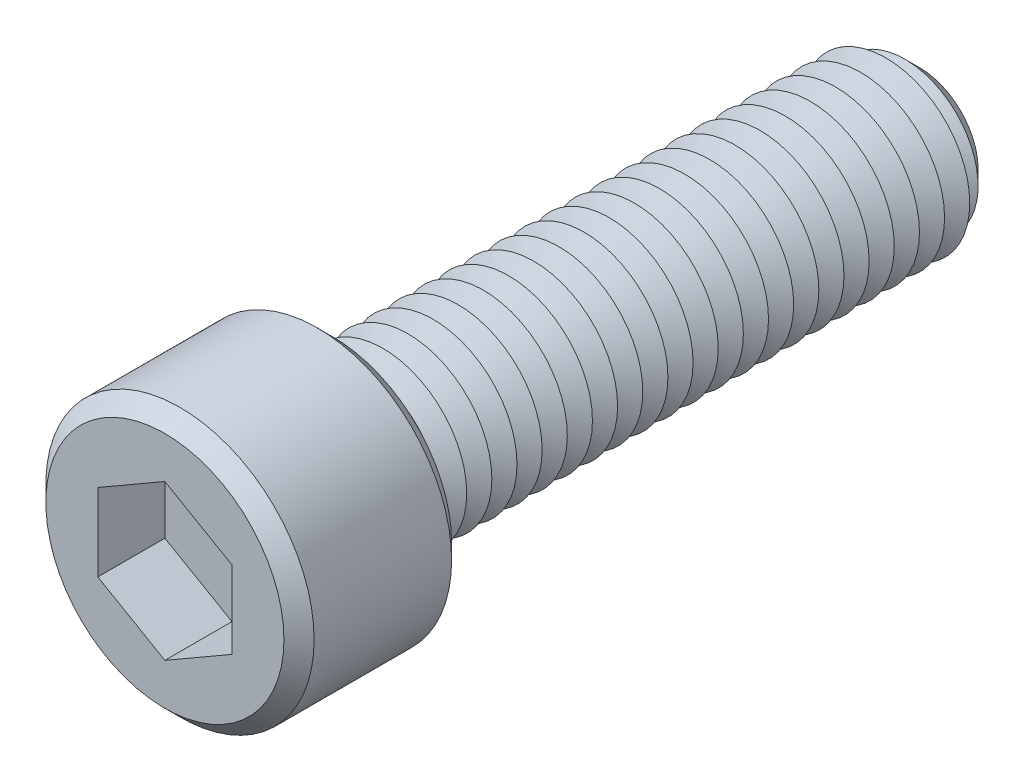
ISO-10303-21;
HEADER;
FILE_DESCRIPTION(('STEP AP214'),'2;1');
FILE_NAME('part.step','',(''),(''),'','','');
FILE_SCHEMA(('AUTOMOTIVE_DESIGN { 1 0 10303 214 1 1 1 1 }'));
ENDSEC;
DATA;
#1=APPLICATION_CONTEXT('core data for automotive mechanical design processes');
#2=APPLICATION_PROTOCOL_DEFINITION('international standard','automotive_design',2000,#1);
#3=PRODUCT_CONTEXT('',#1,'mechanical');
#4=PRODUCT('Part','Part','',(#3));
#5=PRODUCT_RELATED_PRODUCT_CATEGORY('part','',(#4));
#6=PRODUCT_DEFINITION_FORMATION('','',#4);
#7=PRODUCT_DEFINITION_CONTEXT('part definition',#1,'design');
#8=PRODUCT_DEFINITION('design','',#6,#7);
#9=PRODUCT_DEFINITION_SHAPE('','',#8);
#10=(LENGTH_UNIT() NAMED_UNIT(*) SI_UNIT(.MILLI.,.METRE.));
#11=(NAMED_UNIT(*) PLANE_ANGLE_UNIT() SI_UNIT($,.RADIAN.));
#12=(NAMED_UNIT(*) SI_UNIT($,.STERADIAN.) SOLID_ANGLE_UNIT());
#13=UNCERTAINTY_MEASURE_WITH_UNIT(LENGTH_MEASURE(1.E-05),#10,'distance_accuracy_value','');
#14=(GEOMETRIC_REPRESENTATION_CONTEXT(3) GLOBAL_UNCERTAINTY_ASSIGNED_CONTEXT((#13)) GLOBAL_UNIT_ASSIGNED_CONTEXT((#10,
#11,#12)) REPRESENTATION_CONTEXT('',''));
#15=CARTESIAN_POINT('',(0.,0.,0.));
#16=DIRECTION('',(0.,0.,1.));
#17=DIRECTION('',(1.,0.,0.));
#18=AXIS2_PLACEMENT_3D('',#15,#16,#17);
#19=CARTESIAN_POINT('',(0.,0.,10.));
#20=DIRECTION('',(0.,0.,-1.));
#21=DIRECTION('',(-1.,0.,0.));
#22=AXIS2_PLACEMENT_3D('',#19,#20,#21);
#23=CYLINDRICAL_SURFACE('',#22,8.);
#24=CARTESIAN_POINT('',(0.,0.,0.899999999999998));
#25=DIRECTION('',(0.,0.,1.));
#26=DIRECTION('',(1.,0.,0.));
#27=AXIS2_PLACEMENT_3D('',#24,#25,#26);
#28=CIRCLE('',#27,8.);
#29=CARTESIAN_POINT('',(8.,0.,0.899999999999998));
#30=VERTEX_POINT('',#29);
#31=EDGE_CURVE('E360',#30,#30,#28,.T.);
#32=ORIENTED_EDGE('',*,*,#31,.T.);
#33=EDGE_LOOP('',(#32));
#34=FACE_BOUND('',#33,.T.);
#35=CARTESIAN_POINT('',(0.,0.,9.1));
#36=DIRECTION('',(0.,0.,1.));
#37=DIRECTION('',(1.,0.,0.));
#38=AXIS2_PLACEMENT_3D('',#35,#36,#37);
#39=CIRCLE('',#38,8.);
#40=CARTESIAN_POINT('',(8.,0.,9.1));
#41=VERTEX_POINT('',#40);
#42=EDGE_CURVE('E353',#41,#41,#39,.F.);
#43=ORIENTED_EDGE('',*,*,#42,.T.);
#44=EDGE_LOOP('',(#43));
#45=FACE_BOUND('',#44,.T.);
#46=ADVANCED_FACE('F39',(#34,#45),#23,.T.);
#47=CARTESIAN_POINT('',(0.,0.,10.));
#48=DIRECTION('',(0.,0.,1.));
#49=DIRECTION('',(1.,0.,0.));
#50=AXIS2_PLACEMENT_3D('',#47,#48,#49);
#51=PLANE('',#50);
#52=CARTESIAN_POINT('',(0.,0.,10.));
#53=DIRECTION('',(0.,0.,1.));
#54=DIRECTION('',(1.,0.,0.));
#55=AXIS2_PLACEMENT_3D('',#52,#53,#54);
#56=CIRCLE('',#55,7.1);
#57=CARTESIAN_POINT('',(7.1,0.,10.));
#58=VERTEX_POINT('',#57);
#59=EDGE_CURVE('E11',#58,#58,#56,.T.);
#60=ORIENTED_EDGE('',*,*,#59,.T.);
#61=EDGE_LOOP('',(#60));
#62=FACE_BOUND('',#61,.T.);
#63=DIRECTION('',(-0.866025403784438,0.5,0.));
#64=VECTOR('',#63,1.);
#65=CARTESIAN_POINT('',(4.,2.3094010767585,10.));
#66=LINE('',#65,#64);
#67=CARTESIAN_POINT('',(4.,2.3094010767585,10.));
#68=VERTEX_POINT('',#67);
#69=CARTESIAN_POINT('',(0.,4.61880215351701,10.));
#70=VERTEX_POINT('',#69);
#71=EDGE_CURVE('E55',#68,#70,#66,.T.);
#72=ORIENTED_EDGE('',*,*,#71,.F.);
#73=DIRECTION('',(0.,1.,0.));
#74=VECTOR('',#73,1.);
#75=CARTESIAN_POINT('',(4.,-2.30940107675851,10.));
#76=LINE('',#75,#74);
#77=CARTESIAN_POINT('',(4.,-2.30940107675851,10.));
#78=VERTEX_POINT('',#77);
#79=EDGE_CURVE('E150',#78,#68,#76,.T.);
#80=ORIENTED_EDGE('',*,*,#79,.F.);
#81=DIRECTION('',(0.866025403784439,0.5,0.));
#82=VECTOR('',#81,1.);
#83=CARTESIAN_POINT('',(0.,-4.61880215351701,10.));
#84=LINE('',#83,#82);
#85=CARTESIAN_POINT('',(0.,-4.61880215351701,10.));
#86=VERTEX_POINT('',#85);
#87=EDGE_CURVE('E147',#86,#78,#84,.T.);
#88=ORIENTED_EDGE('',*,*,#87,.F.);
#89=DIRECTION('',(0.866025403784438,-0.5,0.));
#90=VECTOR('',#89,1.);
#91=CARTESIAN_POINT('',(-4.,-2.3094010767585,10.));
#92=LINE('',#91,#90);
#93=CARTESIAN_POINT('',(-4.,-2.3094010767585,10.));
#94=VERTEX_POINT('',#93);
#95=EDGE_CURVE('E103',#94,#86,#92,.T.);
#96=ORIENTED_EDGE('',*,*,#95,.F.);
#97=DIRECTION('',(0.,-1.,0.));
#98=VECTOR('',#97,1.);
#99=CARTESIAN_POINT('',(-4.,2.3094010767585,10.));
#100=LINE('',#99,#98);
#101=CARTESIAN_POINT('',(-4.,2.3094010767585,10.));
#102=VERTEX_POINT('',#101);
#103=EDGE_CURVE('E141',#102,#94,#100,.T.);
#104=ORIENTED_EDGE('',*,*,#103,.F.);
#105=DIRECTION('',(-0.866025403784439,-0.5,0.));
#106=VECTOR('',#105,1.);
#107=CARTESIAN_POINT('',(0.,4.61880215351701,10.));
#108=LINE('',#107,#106);
#109=EDGE_CURVE('E136',#70,#102,#108,.T.);
#110=ORIENTED_EDGE('',*,*,#109,.F.);
#111=EDGE_LOOP('',(#72,#80,#88,#96,#104,#110));
#112=FACE_BOUND('',#111,.T.);
#113=ADVANCED_FACE('F378',(#62,#112),#51,.T.);
#114=CARTESIAN_POINT('',(0.,0.,0.));
#115=DIRECTION('',(0.,0.,1.));
#116=DIRECTION('',(1.,0.,0.));
#117=AXIS2_PLACEMENT_3D('',#114,#115,#116);
#118=PLANE('',#117);
#119=CARTESIAN_POINT('',(0.,0.,0.));
#120=DIRECTION('',(0.,0.,1.));
#121=DIRECTION('',(1.,0.,0.));
#122=AXIS2_PLACEMENT_3D('',#119,#120,#121);
#123=CIRCLE('',#122,7.1);
#124=CARTESIAN_POINT('',(7.1,0.,0.));
#125=VERTEX_POINT('',#124);
#126=EDGE_CURVE('E48',#125,#125,#123,.F.);
#127=ORIENTED_EDGE('',*,*,#126,.T.);
#128=EDGE_LOOP('',(#127));
#129=FACE_BOUND('',#128,.T.);
#130=CARTESIAN_POINT('',(0.,0.,0.));
#131=DIRECTION('',(0.,0.,1.));
#132=DIRECTION('',(1.,0.,0.));
#133=AXIS2_PLACEMENT_3D('',#130,#131,#132);
#134=CIRCLE('',#133,5.);
#135=CARTESIAN_POINT('',(5.,0.,0.));
#136=VERTEX_POINT('',#135);
#137=EDGE_CURVE('E345',#136,#136,#134,.T.);
#138=ORIENTED_EDGE('',*,*,#137,.T.);
#139=EDGE_LOOP('',(#138));
#140=FACE_BOUND('',#139,.T.);
#141=ADVANCED_FACE('F367',(#129,#140),#118,.F.);
#142=CARTESIAN_POINT('',(0.,0.,0.));
#143=DIRECTION('',(0.,0.,1.));
#144=DIRECTION('',(1.,0.,0.));
#145=AXIS2_PLACEMENT_3D('',#142,#143,#144);
#146=CONICAL_SURFACE('',#145,5.,1.0471975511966);
#147=CARTESIAN_POINT('',(0.,0.,-0.750000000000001));
#148=DIRECTION('',(0.,0.,1.));
#149=DIRECTION('',(1.,0.,0.));
#150=AXIS2_PLACEMENT_3D('',#147,#148,#149);
#151=CIRCLE('',#150,3.70096189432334);
#152=CARTESIAN_POINT('',(3.70096189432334,0.,-0.750000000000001));
#153=VERTEX_POINT('',#152);
#154=EDGE_CURVE('E341',#153,#153,#151,.T.);
#155=ORIENTED_EDGE('',*,*,#154,.T.);
#156=EDGE_LOOP('',(#155));
#157=FACE_BOUND('',#156,.T.);
#158=ORIENTED_EDGE('',*,*,#137,.F.);
#159=EDGE_LOOP('',(#158));
#160=FACE_BOUND('',#159,.T.);
#161=ADVANCED_FACE('F612',(#157,#160),#146,.T.);
#162=CARTESIAN_POINT('',(0.,0.,-0.750000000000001));
#163=DIRECTION('',(0.,0.,-1.));
#164=DIRECTION('',(-1.,0.,0.));
#165=AXIS2_PLACEMENT_3D('',#162,#163,#164);
#166=CONICAL_SURFACE('',#165,3.70096189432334,1.0471975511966);
#167=CARTESIAN_POINT('',(0.,0.,-1.5));
#168=DIRECTION('',(0.,0.,1.));
#169=DIRECTION('',(1.,0.,0.));
#170=AXIS2_PLACEMENT_3D('',#167,#168,#169);
#171=CIRCLE('',#170,5.);
#172=CARTESIAN_POINT('',(5.,0.,-1.5));
#173=VERTEX_POINT('',#172);
#174=EDGE_CURVE('E337',#173,#173,#171,.T.);
#175=ORIENTED_EDGE('',*,*,#174,.T.);
#176=EDGE_LOOP('',(#175));
#177=FACE_BOUND('',#176,.T.);
#178=ORIENTED_EDGE('',*,*,#154,.F.);
#179=EDGE_LOOP('',(#178));
#180=FACE_BOUND('',#179,.T.);
#181=ADVANCED_FACE('F608',(#177,#180),#166,.T.);
#182=CARTESIAN_POINT('',(0.,0.,-1.5));
#183=DIRECTION('',(0.,0.,1.));
#184=DIRECTION('',(1.,0.,0.));
#185=AXIS2_PLACEMENT_3D('',#182,#183,#184);
#186=CONICAL_SURFACE('',#185,5.,1.0471975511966);
#187=CARTESIAN_POINT('',(0.,0.,-2.25));
#188=DIRECTION('',(0.,0.,1.));
#189=DIRECTION('',(1.,0.,0.));
#190=AXIS2_PLACEMENT_3D('',#187,#188,#189);
#191=CIRCLE('',#190,3.70096189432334);
#192=CARTESIAN_POINT('',(3.70096189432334,0.,-2.25));
#193=VERTEX_POINT('',#192);
#194=EDGE_CURVE('E333',#193,#193,#191,.T.);
#195=ORIENTED_EDGE('',*,*,#194,.T.);
#196=EDGE_LOOP('',(#195));
#197=FACE_BOUND('',#196,.T.);
#198=ORIENTED_EDGE('',*,*,#174,.F.);
#199=EDGE_LOOP('',(#198));
#200=FACE_BOUND('',#199,.T.);
#201=ADVANCED_FACE('F604',(#197,#200),#186,.T.);
#202=CARTESIAN_POINT('',(0.,0.,-2.25));
#203=DIRECTION('',(0.,0.,-1.));
#204=DIRECTION('',(-1.,0.,0.));
#205=AXIS2_PLACEMENT_3D('',#202,#203,#204);
#206=CONICAL_SURFACE('',#205,3.70096189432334,1.0471975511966);
#207=CARTESIAN_POINT('',(0.,0.,-3.));
#208=DIRECTION('',(0.,0.,1.));
#209=DIRECTION('',(1.,0.,0.));
#210=AXIS2_PLACEMENT_3D('',#207,#208,#209);
#211=CIRCLE('',#210,5.);
#212=CARTESIAN_POINT('',(5.,0.,-3.));
#213=VERTEX_POINT('',#212);
#214=EDGE_CURVE('E329',#213,#213,#211,.T.);
#215=ORIENTED_EDGE('',*,*,#214,.T.);
#216=EDGE_LOOP('',(#215));
#217=FACE_BOUND('',#216,.T.);
#218=ORIENTED_EDGE('',*,*,#194,.F.);
#219=EDGE_LOOP('',(#218));
#220=FACE_BOUND('',#219,.T.);
#221=ADVANCED_FACE('F600',(#217,#220),#206,.T.);
#222=CARTESIAN_POINT('',(0.,0.,-3.));
#223=DIRECTION('',(0.,0.,1.));
#224=DIRECTION('',(1.,0.,0.));
#225=AXIS2_PLACEMENT_3D('',#222,#223,#224);
#226=CONICAL_SURFACE('',#225,5.,1.0471975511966);
#227=CARTESIAN_POINT('',(0.,0.,-3.75));
#228=DIRECTION('',(0.,0.,1.));
#229=DIRECTION('',(1.,0.,0.));
#230=AXIS2_PLACEMENT_3D('',#227,#228,#229);
#231=CIRCLE('',#230,3.70096189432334);
#232=CARTESIAN_POINT('',(3.70096189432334,0.,-3.75));
#233=VERTEX_POINT('',#232);
#234=EDGE_CURVE('E325',#233,#233,#231,.T.);
#235=ORIENTED_EDGE('',*,*,#234,.T.);
#236=EDGE_LOOP('',(#235));
#237=FACE_BOUND('',#236,.T.);
#238=ORIENTED_EDGE('',*,*,#214,.F.);
#239=EDGE_LOOP('',(#238));
#240=FACE_BOUND('',#239,.T.);
#241=ADVANCED_FACE('F596',(#237,#240),#226,.T.);
#242=CARTESIAN_POINT('',(0.,0.,-3.75));
#243=DIRECTION('',(0.,0.,-1.));
#244=DIRECTION('',(-1.,0.,0.));
#245=AXIS2_PLACEMENT_3D('',#242,#243,#244);
#246=CONICAL_SURFACE('',#245,3.70096189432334,1.0471975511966);
#247=CARTESIAN_POINT('',(0.,0.,-4.5));
#248=DIRECTION('',(0.,0.,1.));
#249=DIRECTION('',(1.,0.,0.));
#250=AXIS2_PLACEMENT_3D('',#247,#248,#249);
#251=CIRCLE('',#250,5.);
#252=CARTESIAN_POINT('',(5.,0.,-4.5));
#253=VERTEX_POINT('',#252);
#254=EDGE_CURVE('E321',#253,#253,#251,.T.);
#255=ORIENTED_EDGE('',*,*,#254,.T.);
#256=EDGE_LOOP('',(#255));
#257=FACE_BOUND('',#256,.T.);
#258=ORIENTED_EDGE('',*,*,#234,.F.);
#259=EDGE_LOOP('',(#258));
#260=FACE_BOUND('',#259,.T.);
#261=ADVANCED_FACE('F592',(#257,#260),#246,.T.);
#262=CARTESIAN_POINT('',(0.,0.,-4.5));
#263=DIRECTION('',(0.,0.,1.));
#264=DIRECTION('',(1.,0.,0.));
#265=AXIS2_PLACEMENT_3D('',#262,#263,#264);
#266=CONICAL_SURFACE('',#265,5.,1.0471975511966);
#267=CARTESIAN_POINT('',(0.,0.,-5.25));
#268=DIRECTION('',(0.,0.,1.));
#269=DIRECTION('',(1.,0.,0.));
#270=AXIS2_PLACEMENT_3D('',#267,#268,#269);
#271=CIRCLE('',#270,3.70096189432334);
#272=CARTESIAN_POINT('',(3.70096189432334,0.,-5.25));
#273=VERTEX_POINT('',#272);
#274=EDGE_CURVE('E317',#273,#273,#271,.T.);
#275=ORIENTED_EDGE('',*,*,#274,.T.);
#276=EDGE_LOOP('',(#275));
#277=FACE_BOUND('',#276,.T.);
#278=ORIENTED_EDGE('',*,*,#254,.F.);
#279=EDGE_LOOP('',(#278));
#280=FACE_BOUND('',#279,.T.);
#281=ADVANCED_FACE('F588',(#277,#280),#266,.T.);
#282=CARTESIAN_POINT('',(0.,0.,-5.25));
#283=DIRECTION('',(0.,0.,-1.));
#284=DIRECTION('',(-1.,0.,0.));
#285=AXIS2_PLACEMENT_3D('',#282,#283,#284);
#286=CONICAL_SURFACE('',#285,3.70096189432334,1.0471975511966);
#287=CARTESIAN_POINT('',(0.,0.,-6.));
#288=DIRECTION('',(0.,0.,1.));
#289=DIRECTION('',(1.,0.,0.));
#290=AXIS2_PLACEMENT_3D('',#287,#288,#289);
#291=CIRCLE('',#290,5.);
#292=CARTESIAN_POINT('',(5.,0.,-6.));
#293=VERTEX_POINT('',#292);
#294=EDGE_CURVE('E313',#293,#293,#291,.T.);
#295=ORIENTED_EDGE('',*,*,#294,.T.);
#296=EDGE_LOOP('',(#295));
#297=FACE_BOUND('',#296,.T.);
#298=ORIENTED_EDGE('',*,*,#274,.F.);
#299=EDGE_LOOP('',(#298));
#300=FACE_BOUND('',#299,.T.);
#301=ADVANCED_FACE('F584',(#297,#300),#286,.T.);
#302=CARTESIAN_POINT('',(0.,0.,-6.));
#303=DIRECTION('',(0.,0.,1.));
#304=DIRECTION('',(1.,0.,0.));
#305=AXIS2_PLACEMENT_3D('',#302,#303,#304);
#306=CONICAL_SURFACE('',#305,5.,1.0471975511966);
#307=CARTESIAN_POINT('',(0.,0.,-6.75));
#308=DIRECTION('',(0.,0.,1.));
#309=DIRECTION('',(1.,0.,0.));
#310=AXIS2_PLACEMENT_3D('',#307,#308,#309);
#311=CIRCLE('',#310,3.70096189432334);
#312=CARTESIAN_POINT('',(3.70096189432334,0.,-6.75));
#313=VERTEX_POINT('',#312);
#314=EDGE_CURVE('E309',#313,#313,#311,.T.);
#315=ORIENTED_EDGE('',*,*,#314,.T.);
#316=EDGE_LOOP('',(#315));
#317=FACE_BOUND('',#316,.T.);
#318=ORIENTED_EDGE('',*,*,#294,.F.);
#319=EDGE_LOOP('',(#318));
#320=FACE_BOUND('',#319,.T.);
#321=ADVANCED_FACE('F580',(#317,#320),#306,.T.);
#322=CARTESIAN_POINT('',(0.,0.,-6.75));
#323=DIRECTION('',(0.,0.,-1.));
#324=DIRECTION('',(-1.,0.,0.));
#325=AXIS2_PLACEMENT_3D('',#322,#323,#324);
#326=CONICAL_SURFACE('',#325,3.70096189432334,1.0471975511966);
#327=CARTESIAN_POINT('',(0.,0.,-7.5));
#328=DIRECTION('',(0.,0.,1.));
#329=DIRECTION('',(1.,0.,0.));
#330=AXIS2_PLACEMENT_3D('',#327,#328,#329);
#331=CIRCLE('',#330,5.);
#332=CARTESIAN_POINT('',(5.,0.,-7.5));
#333=VERTEX_POINT('',#332);
#334=EDGE_CURVE('E305',#333,#333,#331,.T.);
#335=ORIENTED_EDGE('',*,*,#334,.T.);
#336=EDGE_LOOP('',(#335));
#337=FACE_BOUND('',#336,.T.);
#338=ORIENTED_EDGE('',*,*,#314,.F.);
#339=EDGE_LOOP('',(#338));
#340=FACE_BOUND('',#339,.T.);
#341=ADVANCED_FACE('F576',(#337,#340),#326,.T.);
#342=CARTESIAN_POINT('',(0.,0.,-7.5));
#343=DIRECTION('',(0.,0.,1.));
#344=DIRECTION('',(1.,0.,0.));
#345=AXIS2_PLACEMENT_3D('',#342,#343,#344);
#346=CONICAL_SURFACE('',#345,5.,1.0471975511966);
#347=CARTESIAN_POINT('',(0.,0.,-8.25));
#348=DIRECTION('',(0.,0.,1.));
#349=DIRECTION('',(1.,0.,0.));
#350=AXIS2_PLACEMENT_3D('',#347,#348,#349);
#351=CIRCLE('',#350,3.70096189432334);
#352=CARTESIAN_POINT('',(3.70096189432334,0.,-8.25));
#353=VERTEX_POINT('',#352);
#354=EDGE_CURVE('E301',#353,#353,#351,.T.);
#355=ORIENTED_EDGE('',*,*,#354,.T.);
#356=EDGE_LOOP('',(#355));
#357=FACE_BOUND('',#356,.T.);
#358=ORIENTED_EDGE('',*,*,#334,.F.);
#359=EDGE_LOOP('',(#358));
#360=FACE_BOUND('',#359,.T.);
#361=ADVANCED_FACE('F572',(#357,#360),#346,.T.);
#362=CARTESIAN_POINT('',(0.,0.,-8.25));
#363=DIRECTION('',(0.,0.,-1.));
#364=DIRECTION('',(-1.,0.,0.));
#365=AXIS2_PLACEMENT_3D('',#362,#363,#364);
#366=CONICAL_SURFACE('',#365,3.70096189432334,1.0471975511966);
#367=CARTESIAN_POINT('',(0.,0.,-9.));
#368=DIRECTION('',(0.,0.,1.));
#369=DIRECTION('',(1.,0.,0.));
#370=AXIS2_PLACEMENT_3D('',#367,#368,#369);
#371=CIRCLE('',#370,5.);
#372=CARTESIAN_POINT('',(5.,0.,-9.));
#373=VERTEX_POINT('',#372);
#374=EDGE_CURVE('E297',#373,#373,#371,.T.);
#375=ORIENTED_EDGE('',*,*,#374,.T.);
#376=EDGE_LOOP('',(#375));
#377=FACE_BOUND('',#376,.T.);
#378=ORIENTED_EDGE('',*,*,#354,.F.);
#379=EDGE_LOOP('',(#378));
#380=FACE_BOUND('',#379,.T.);
#381=ADVANCED_FACE('F568',(#377,#380),#366,.T.);
#382=CARTESIAN_POINT('',(0.,0.,-9.));
#383=DIRECTION('',(0.,0.,1.));
#384=DIRECTION('',(1.,0.,0.));
#385=AXIS2_PLACEMENT_3D('',#382,#383,#384);
#386=CONICAL_SURFACE('',#385,5.,1.0471975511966);
#387=CARTESIAN_POINT('',(0.,0.,-9.75));
#388=DIRECTION('',(0.,0.,1.));
#389=DIRECTION('',(1.,0.,0.));
#390=AXIS2_PLACEMENT_3D('',#387,#388,#389);
#391=CIRCLE('',#390,3.70096189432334);
#392=CARTESIAN_POINT('',(3.70096189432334,0.,-9.75));
#393=VERTEX_POINT('',#392);
#394=EDGE_CURVE('E293',#393,#393,#391,.T.);
#395=ORIENTED_EDGE('',*,*,#394,.T.);
#396=EDGE_LOOP('',(#395));
#397=FACE_BOUND('',#396,.T.);
#398=ORIENTED_EDGE('',*,*,#374,.F.);
#399=EDGE_LOOP('',(#398));
#400=FACE_BOUND('',#399,.T.);
#401=ADVANCED_FACE('F564',(#397,#400),#386,.T.);
#402=CARTESIAN_POINT('',(0.,0.,-9.75));
#403=DIRECTION('',(0.,0.,-1.));
#404=DIRECTION('',(-1.,0.,0.));
#405=AXIS2_PLACEMENT_3D('',#402,#403,#404);
#406=CONICAL_SURFACE('',#405,3.70096189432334,1.0471975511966);
#407=CARTESIAN_POINT('',(0.,0.,-10.5));
#408=DIRECTION('',(0.,0.,1.));
#409=DIRECTION('',(1.,0.,0.));
#410=AXIS2_PLACEMENT_3D('',#407,#408,#409);
#411=CIRCLE('',#410,5.);
#412=CARTESIAN_POINT('',(5.,0.,-10.5));
#413=VERTEX_POINT('',#412);
#414=EDGE_CURVE('E289',#413,#413,#411,.T.);
#415=ORIENTED_EDGE('',*,*,#414,.T.);
#416=EDGE_LOOP('',(#415));
#417=FACE_BOUND('',#416,.T.);
#418=ORIENTED_EDGE('',*,*,#394,.F.);
#419=EDGE_LOOP('',(#418));
#420=FACE_BOUND('',#419,.T.);
#421=ADVANCED_FACE('F560',(#417,#420),#406,.T.);
#422=CARTESIAN_POINT('',(0.,0.,-10.5));
#423=DIRECTION('',(0.,0.,1.));
#424=DIRECTION('',(1.,0.,0.));
#425=AXIS2_PLACEMENT_3D('',#422,#423,#424);
#426=CONICAL_SURFACE('',#425,5.,1.0471975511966);
#427=CARTESIAN_POINT('',(0.,0.,-11.25));
#428=DIRECTION('',(0.,0.,1.));
#429=DIRECTION('',(1.,0.,0.));
#430=AXIS2_PLACEMENT_3D('',#427,#428,#429);
#431=CIRCLE('',#430,3.70096189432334);
#432=CARTESIAN_POINT('',(3.70096189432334,0.,-11.25));
#433=VERTEX_POINT('',#432);
#434=EDGE_CURVE('E285',#433,#433,#431,.T.);
#435=ORIENTED_EDGE('',*,*,#434,.T.);
#436=EDGE_LOOP('',(#435));
#437=FACE_BOUND('',#436,.T.);
#438=ORIENTED_EDGE('',*,*,#414,.F.);
#439=EDGE_LOOP('',(#438));
#440=FACE_BOUND('',#439,.T.);
#441=ADVANCED_FACE('F556',(#437,#440),#426,.T.);
#442=CARTESIAN_POINT('',(0.,0.,-11.25));
#443=DIRECTION('',(0.,0.,-1.));
#444=DIRECTION('',(-1.,0.,0.));
#445=AXIS2_PLACEMENT_3D('',#442,#443,#444);
#446=CONICAL_SURFACE('',#445,3.70096189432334,1.0471975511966);
#447=CARTESIAN_POINT('',(0.,0.,-12.));
#448=DIRECTION('',(0.,0.,1.));
#449=DIRECTION('',(1.,0.,0.));
#450=AXIS2_PLACEMENT_3D('',#447,#448,#449);
#451=CIRCLE('',#450,5.);
#452=CARTESIAN_POINT('',(5.,0.,-12.));
#453=VERTEX_POINT('',#452);
#454=EDGE_CURVE('E281',#453,#453,#451,.T.);
#455=ORIENTED_EDGE('',*,*,#454,.T.);
#456=EDGE_LOOP('',(#455));
#457=FACE_BOUND('',#456,.T.);
#458=ORIENTED_EDGE('',*,*,#434,.F.);
#459=EDGE_LOOP('',(#458));
#460=FACE_BOUND('',#459,.T.);
#461=ADVANCED_FACE('F552',(#457,#460),#446,.T.);
#462=CARTESIAN_POINT('',(0.,0.,-12.));
#463=DIRECTION('',(0.,0.,1.));
#464=DIRECTION('',(1.,0.,0.));
#465=AXIS2_PLACEMENT_3D('',#462,#463,#464);
#466=CONICAL_SURFACE('',#465,5.,1.0471975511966);
#467=CARTESIAN_POINT('',(0.,0.,-12.75));
#468=DIRECTION('',(0.,0.,1.));
#469=DIRECTION('',(1.,0.,0.));
#470=AXIS2_PLACEMENT_3D('',#467,#468,#469);
#471=CIRCLE('',#470,3.70096189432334);
#472=CARTESIAN_POINT('',(3.70096189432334,0.,-12.75));
#473=VERTEX_POINT('',#472);
#474=EDGE_CURVE('E277',#473,#473,#471,.T.);
#475=ORIENTED_EDGE('',*,*,#474,.T.);
#476=EDGE_LOOP('',(#475));
#477=FACE_BOUND('',#476,.T.);
#478=ORIENTED_EDGE('',*,*,#454,.F.);
#479=EDGE_LOOP('',(#478));
#480=FACE_BOUND('',#479,.T.);
#481=ADVANCED_FACE('F548',(#477,#480),#466,.T.);
#482=CARTESIAN_POINT('',(0.,0.,-12.75));
#483=DIRECTION('',(0.,0.,-1.));
#484=DIRECTION('',(-1.,0.,0.));
#485=AXIS2_PLACEMENT_3D('',#482,#483,#484);
#486=CONICAL_SURFACE('',#485,3.70096189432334,1.0471975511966);
#487=CARTESIAN_POINT('',(0.,0.,-13.5));
#488=DIRECTION('',(0.,0.,1.));
#489=DIRECTION('',(1.,0.,0.));
#490=AXIS2_PLACEMENT_3D('',#487,#488,#489);
#491=CIRCLE('',#490,5.);
#492=CARTESIAN_POINT('',(5.,0.,-13.5));
#493=VERTEX_POINT('',#492);
#494=EDGE_CURVE('E273',#493,#493,#491,.T.);
#495=ORIENTED_EDGE('',*,*,#494,.T.);
#496=EDGE_LOOP('',(#495));
#497=FACE_BOUND('',#496,.T.);
#498=ORIENTED_EDGE('',*,*,#474,.F.);
#499=EDGE_LOOP('',(#498));
#500=FACE_BOUND('',#499,.T.);
#501=ADVANCED_FACE('F544',(#497,#500),#486,.T.);
#502=CARTESIAN_POINT('',(0.,0.,-13.5));
#503=DIRECTION('',(0.,0.,1.));
#504=DIRECTION('',(1.,0.,0.));
#505=AXIS2_PLACEMENT_3D('',#502,#503,#504);
#506=CONICAL_SURFACE('',#505,5.,1.0471975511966);
#507=CARTESIAN_POINT('',(0.,0.,-14.25));
#508=DIRECTION('',(0.,0.,1.));
#509=DIRECTION('',(1.,0.,0.));
#510=AXIS2_PLACEMENT_3D('',#507,#508,#509);
#511=CIRCLE('',#510,3.70096189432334);
#512=CARTESIAN_POINT('',(3.70096189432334,0.,-14.25));
#513=VERTEX_POINT('',#512);
#514=EDGE_CURVE('E269',#513,#513,#511,.T.);
#515=ORIENTED_EDGE('',*,*,#514,.T.);
#516=EDGE_LOOP('',(#515));
#517=FACE_BOUND('',#516,.T.);
#518=ORIENTED_EDGE('',*,*,#494,.F.);
#519=EDGE_LOOP('',(#518));
#520=FACE_BOUND('',#519,.T.);
#521=ADVANCED_FACE('F540',(#517,#520),#506,.T.);
#522=CARTESIAN_POINT('',(0.,0.,-14.25));
#523=DIRECTION('',(0.,0.,-1.));
#524=DIRECTION('',(-1.,0.,0.));
#525=AXIS2_PLACEMENT_3D('',#522,#523,#524);
#526=CONICAL_SURFACE('',#525,3.70096189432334,1.0471975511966);
#527=CARTESIAN_POINT('',(0.,0.,-15.));
#528=DIRECTION('',(0.,0.,1.));
#529=DIRECTION('',(1.,0.,0.));
#530=AXIS2_PLACEMENT_3D('',#527,#528,#529);
#531=CIRCLE('',#530,5.);
#532=CARTESIAN_POINT('',(5.,0.,-15.));
#533=VERTEX_POINT('',#532);
#534=EDGE_CURVE('E265',#533,#533,#531,.T.);
#535=ORIENTED_EDGE('',*,*,#534,.T.);
#536=EDGE_LOOP('',(#535));
#537=FACE_BOUND('',#536,.T.);
#538=ORIENTED_EDGE('',*,*,#514,.F.);
#539=EDGE_LOOP('',(#538));
#540=FACE_BOUND('',#539,.T.);
#541=ADVANCED_FACE('F536',(#537,#540),#526,.T.);
#542=CARTESIAN_POINT('',(0.,0.,-15.));
#543=DIRECTION('',(0.,0.,1.));
#544=DIRECTION('',(1.,0.,0.));
#545=AXIS2_PLACEMENT_3D('',#542,#543,#544);
#546=CONICAL_SURFACE('',#545,5.,1.0471975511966);
#547=CARTESIAN_POINT('',(0.,0.,-15.75));
#548=DIRECTION('',(0.,0.,1.));
#549=DIRECTION('',(1.,0.,0.));
#550=AXIS2_PLACEMENT_3D('',#547,#548,#549);
#551=CIRCLE('',#550,3.70096189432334);
#552=CARTESIAN_POINT('',(3.70096189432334,0.,-15.75));
#553=VERTEX_POINT('',#552);
#554=EDGE_CURVE('E261',#553,#553,#551,.T.);
#555=ORIENTED_EDGE('',*,*,#554,.T.);
#556=EDGE_LOOP('',(#555));
#557=FACE_BOUND('',#556,.T.);
#558=ORIENTED_EDGE('',*,*,#534,.F.);
#559=EDGE_LOOP('',(#558));
#560=FACE_BOUND('',#559,.T.);
#561=ADVANCED_FACE('F532',(#557,#560),#546,.T.);
#562=CARTESIAN_POINT('',(0.,0.,-15.75));
#563=DIRECTION('',(0.,0.,-1.));
#564=DIRECTION('',(-1.,0.,0.));
#565=AXIS2_PLACEMENT_3D('',#562,#563,#564);
#566=CONICAL_SURFACE('',#565,3.70096189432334,1.0471975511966);
#567=CARTESIAN_POINT('',(0.,0.,-16.5));
#568=DIRECTION('',(0.,0.,1.));
#569=DIRECTION('',(1.,0.,0.));
#570=AXIS2_PLACEMENT_3D('',#567,#568,#569);
#571=CIRCLE('',#570,5.);
#572=CARTESIAN_POINT('',(5.,0.,-16.5));
#573=VERTEX_POINT('',#572);
#574=EDGE_CURVE('E257',#573,#573,#571,.T.);
#575=ORIENTED_EDGE('',*,*,#574,.T.);
#576=EDGE_LOOP('',(#575));
#577=FACE_BOUND('',#576,.T.);
#578=ORIENTED_EDGE('',*,*,#554,.F.);
#579=EDGE_LOOP('',(#578));
#580=FACE_BOUND('',#579,.T.);
#581=ADVANCED_FACE('F528',(#577,#580),#566,.T.);
#582=CARTESIAN_POINT('',(0.,0.,-16.5));
#583=DIRECTION('',(0.,0.,1.));
#584=DIRECTION('',(1.,0.,0.));
#585=AXIS2_PLACEMENT_3D('',#582,#583,#584);
#586=CONICAL_SURFACE('',#585,5.,1.0471975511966);
#587=CARTESIAN_POINT('',(0.,0.,-17.25));
#588=DIRECTION('',(0.,0.,1.));
#589=DIRECTION('',(1.,0.,0.));
#590=AXIS2_PLACEMENT_3D('',#587,#588,#589);
#591=CIRCLE('',#590,3.70096189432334);
#592=CARTESIAN_POINT('',(3.70096189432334,0.,-17.25));
#593=VERTEX_POINT('',#592);
#594=EDGE_CURVE('E253',#593,#593,#591,.T.);
#595=ORIENTED_EDGE('',*,*,#594,.T.);
#596=EDGE_LOOP('',(#595));
#597=FACE_BOUND('',#596,.T.);
#598=ORIENTED_EDGE('',*,*,#574,.F.);
#599=EDGE_LOOP('',(#598));
#600=FACE_BOUND('',#599,.T.);
#601=ADVANCED_FACE('F524',(#597,#600),#586,.T.);
#602=CARTESIAN_POINT('',(0.,0.,-17.25));
#603=DIRECTION('',(0.,0.,-1.));
#604=DIRECTION('',(-1.,0.,0.));
#605=AXIS2_PLACEMENT_3D('',#602,#603,#604);
#606=CONICAL_SURFACE('',#605,3.70096189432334,1.0471975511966);
#607=CARTESIAN_POINT('',(0.,0.,-18.));
#608=DIRECTION('',(0.,0.,1.));
#609=DIRECTION('',(1.,0.,0.));
#610=AXIS2_PLACEMENT_3D('',#607,#608,#609);
#611=CIRCLE('',#610,5.);
#612=CARTESIAN_POINT('',(5.,0.,-18.));
#613=VERTEX_POINT('',#612);
#614=EDGE_CURVE('E249',#613,#613,#611,.T.);
#615=ORIENTED_EDGE('',*,*,#614,.T.);
#616=EDGE_LOOP('',(#615));
#617=FACE_BOUND('',#616,.T.);
#618=ORIENTED_EDGE('',*,*,#594,.F.);
#619=EDGE_LOOP('',(#618));
#620=FACE_BOUND('',#619,.T.);
#621=ADVANCED_FACE('F520',(#617,#620),#606,.T.);
#622=CARTESIAN_POINT('',(0.,0.,-18.));
#623=DIRECTION('',(0.,0.,1.));
#624=DIRECTION('',(1.,0.,0.));
#625=AXIS2_PLACEMENT_3D('',#622,#623,#624);
#626=CONICAL_SURFACE('',#625,5.,1.0471975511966);
#627=CARTESIAN_POINT('',(0.,0.,-18.75));
#628=DIRECTION('',(0.,0.,1.));
#629=DIRECTION('',(1.,0.,0.));
#630=AXIS2_PLACEMENT_3D('',#627,#628,#629);
#631=CIRCLE('',#630,3.70096189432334);
#632=CARTESIAN_POINT('',(3.70096189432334,0.,-18.75));
#633=VERTEX_POINT('',#632);
#634=EDGE_CURVE('E245',#633,#633,#631,.T.);
#635=ORIENTED_EDGE('',*,*,#634,.T.);
#636=EDGE_LOOP('',(#635));
#637=FACE_BOUND('',#636,.T.);
#638=ORIENTED_EDGE('',*,*,#614,.F.);
#639=EDGE_LOOP('',(#638));
#640=FACE_BOUND('',#639,.T.);
#641=ADVANCED_FACE('F516',(#637,#640),#626,.T.);
#642=CARTESIAN_POINT('',(0.,0.,-18.75));
#643=DIRECTION('',(0.,0.,-1.));
#644=DIRECTION('',(-1.,0.,0.));
#645=AXIS2_PLACEMENT_3D('',#642,#643,#644);
#646=CONICAL_SURFACE('',#645,3.70096189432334,1.0471975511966);
#647=CARTESIAN_POINT('',(0.,0.,-19.5));
#648=DIRECTION('',(0.,0.,1.));
#649=DIRECTION('',(1.,0.,0.));
#650=AXIS2_PLACEMENT_3D('',#647,#648,#649);
#651=CIRCLE('',#650,5.);
#652=CARTESIAN_POINT('',(5.,0.,-19.5));
#653=VERTEX_POINT('',#652);
#654=EDGE_CURVE('E241',#653,#653,#651,.T.);
#655=ORIENTED_EDGE('',*,*,#654,.T.);
#656=EDGE_LOOP('',(#655));
#657=FACE_BOUND('',#656,.T.);
#658=ORIENTED_EDGE('',*,*,#634,.F.);
#659=EDGE_LOOP('',(#658));
#660=FACE_BOUND('',#659,.T.);
#661=ADVANCED_FACE('F512',(#657,#660),#646,.T.);
#662=CARTESIAN_POINT('',(0.,0.,-19.5));
#663=DIRECTION('',(0.,0.,1.));
#664=DIRECTION('',(1.,0.,0.));
#665=AXIS2_PLACEMENT_3D('',#662,#663,#664);
#666=CONICAL_SURFACE('',#665,5.,1.0471975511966);
#667=CARTESIAN_POINT('',(0.,0.,-20.25));
#668=DIRECTION('',(0.,0.,1.));
#669=DIRECTION('',(1.,0.,0.));
#670=AXIS2_PLACEMENT_3D('',#667,#668,#669);
#671=CIRCLE('',#670,3.70096189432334);
#672=CARTESIAN_POINT('',(3.70096189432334,0.,-20.25));
#673=VERTEX_POINT('',#672);
#674=EDGE_CURVE('E237',#673,#673,#671,.T.);
#675=ORIENTED_EDGE('',*,*,#674,.T.);
#676=EDGE_LOOP('',(#675));
#677=FACE_BOUND('',#676,.T.);
#678=ORIENTED_EDGE('',*,*,#654,.F.);
#679=EDGE_LOOP('',(#678));
#680=FACE_BOUND('',#679,.T.);
#681=ADVANCED_FACE('F508',(#677,#680),#666,.T.);
#682=CARTESIAN_POINT('',(0.,0.,-20.25));
#683=DIRECTION('',(0.,0.,-1.));
#684=DIRECTION('',(-1.,0.,0.));
#685=AXIS2_PLACEMENT_3D('',#682,#683,#684);
#686=CONICAL_SURFACE('',#685,3.70096189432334,1.0471975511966);
#687=CARTESIAN_POINT('',(0.,0.,-21.));
#688=DIRECTION('',(0.,0.,1.));
#689=DIRECTION('',(1.,0.,0.));
#690=AXIS2_PLACEMENT_3D('',#687,#688,#689);
#691=CIRCLE('',#690,5.);
#692=CARTESIAN_POINT('',(5.,0.,-21.));
#693=VERTEX_POINT('',#692);
#694=EDGE_CURVE('E233',#693,#693,#691,.T.);
#695=ORIENTED_EDGE('',*,*,#694,.T.);
#696=EDGE_LOOP('',(#695));
#697=FACE_BOUND('',#696,.T.);
#698=ORIENTED_EDGE('',*,*,#674,.F.);
#699=EDGE_LOOP('',(#698));
#700=FACE_BOUND('',#699,.T.);
#701=ADVANCED_FACE('F504',(#697,#700),#686,.T.);
#702=CARTESIAN_POINT('',(0.,0.,-21.));
#703=DIRECTION('',(0.,0.,1.));
#704=DIRECTION('',(1.,0.,0.));
#705=AXIS2_PLACEMENT_3D('',#702,#703,#704);
#706=CONICAL_SURFACE('',#705,5.,1.0471975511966);
#707=CARTESIAN_POINT('',(0.,0.,-21.75));
#708=DIRECTION('',(0.,0.,1.));
#709=DIRECTION('',(1.,0.,0.));
#710=AXIS2_PLACEMENT_3D('',#707,#708,#709);
#711=CIRCLE('',#710,3.70096189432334);
#712=CARTESIAN_POINT('',(3.70096189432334,0.,-21.75));
#713=VERTEX_POINT('',#712);
#714=EDGE_CURVE('E229',#713,#713,#711,.T.);
#715=ORIENTED_EDGE('',*,*,#714,.T.);
#716=EDGE_LOOP('',(#715));
#717=FACE_BOUND('',#716,.T.);
#718=ORIENTED_EDGE('',*,*,#694,.F.);
#719=EDGE_LOOP('',(#718));
#720=FACE_BOUND('',#719,.T.);
#721=ADVANCED_FACE('F500',(#717,#720),#706,.T.);
#722=CARTESIAN_POINT('',(0.,0.,-21.75));
#723=DIRECTION('',(0.,0.,-1.));
#724=DIRECTION('',(-1.,0.,0.));
#725=AXIS2_PLACEMENT_3D('',#722,#723,#724);
#726=CONICAL_SURFACE('',#725,3.70096189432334,1.0471975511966);
#727=CARTESIAN_POINT('',(0.,0.,-22.5));
#728=DIRECTION('',(0.,0.,1.));
#729=DIRECTION('',(1.,0.,0.));
#730=AXIS2_PLACEMENT_3D('',#727,#728,#729);
#731=CIRCLE('',#730,5.);
#732=CARTESIAN_POINT('',(5.,0.,-22.5));
#733=VERTEX_POINT('',#732);
#734=EDGE_CURVE('E226',#733,#733,#731,.T.);
#735=ORIENTED_EDGE('',*,*,#734,.T.);
#736=EDGE_LOOP('',(#735));
#737=FACE_BOUND('',#736,.T.);
#738=ORIENTED_EDGE('',*,*,#714,.F.);
#739=EDGE_LOOP('',(#738));
#740=FACE_BOUND('',#739,.T.);
#741=ADVANCED_FACE('F496',(#737,#740),#726,.T.);
#742=CARTESIAN_POINT('',(0.,0.,-22.5));
#743=DIRECTION('',(0.,0.,1.));
#744=DIRECTION('',(1.,0.,0.));
#745=AXIS2_PLACEMENT_3D('',#742,#743,#744);
#746=CONICAL_SURFACE('',#745,5.,1.0471975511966);
#747=CARTESIAN_POINT('',(0.,0.,-23.25));
#748=DIRECTION('',(0.,0.,1.));
#749=DIRECTION('',(1.,0.,0.));
#750=AXIS2_PLACEMENT_3D('',#747,#748,#749);
#751=CIRCLE('',#750,3.70096189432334);
#752=CARTESIAN_POINT('',(3.70096189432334,0.,-23.25));
#753=VERTEX_POINT('',#752);
#754=EDGE_CURVE('E222',#753,#753,#751,.T.);
#755=ORIENTED_EDGE('',*,*,#754,.T.);
#756=EDGE_LOOP('',(#755));
#757=FACE_BOUND('',#756,.T.);
#758=ORIENTED_EDGE('',*,*,#734,.F.);
#759=EDGE_LOOP('',(#758));
#760=FACE_BOUND('',#759,.T.);
#761=ADVANCED_FACE('F492',(#757,#760),#746,.T.);
#762=CARTESIAN_POINT('',(0.,0.,-23.25));
#763=DIRECTION('',(0.,0.,-1.));
#764=DIRECTION('',(-1.,0.,0.));
#765=AXIS2_PLACEMENT_3D('',#762,#763,#764);
#766=CONICAL_SURFACE('',#765,3.70096189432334,1.0471975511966);
#767=CARTESIAN_POINT('',(0.,0.,-24.));
#768=DIRECTION('',(0.,0.,1.));
#769=DIRECTION('',(1.,0.,0.));
#770=AXIS2_PLACEMENT_3D('',#767,#768,#769);
#771=CIRCLE('',#770,5.);
#772=CARTESIAN_POINT('',(5.,0.,-24.));
#773=VERTEX_POINT('',#772);
#774=EDGE_CURVE('E218',#773,#773,#771,.T.);
#775=ORIENTED_EDGE('',*,*,#774,.T.);
#776=EDGE_LOOP('',(#775));
#777=FACE_BOUND('',#776,.T.);
#778=ORIENTED_EDGE('',*,*,#754,.F.);
#779=EDGE_LOOP('',(#778));
#780=FACE_BOUND('',#779,.T.);
#781=ADVANCED_FACE('F488',(#777,#780),#766,.T.);
#782=CARTESIAN_POINT('',(0.,0.,-24.));
#783=DIRECTION('',(0.,0.,1.));
#784=DIRECTION('',(1.,0.,0.));
#785=AXIS2_PLACEMENT_3D('',#782,#783,#784);
#786=CONICAL_SURFACE('',#785,5.,1.0471975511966);
#787=CARTESIAN_POINT('',(0.,0.,-24.75));
#788=DIRECTION('',(0.,0.,1.));
#789=DIRECTION('',(1.,0.,0.));
#790=AXIS2_PLACEMENT_3D('',#787,#788,#789);
#791=CIRCLE('',#790,3.70096189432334);
#792=CARTESIAN_POINT('',(3.70096189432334,0.,-24.75));
#793=VERTEX_POINT('',#792);
#794=EDGE_CURVE('E214',#793,#793,#791,.T.);
#795=ORIENTED_EDGE('',*,*,#794,.T.);
#796=EDGE_LOOP('',(#795));
#797=FACE_BOUND('',#796,.T.);
#798=ORIENTED_EDGE('',*,*,#774,.F.);
#799=EDGE_LOOP('',(#798));
#800=FACE_BOUND('',#799,.T.);
#801=ADVANCED_FACE('F484',(#797,#800),#786,.T.);
#802=CARTESIAN_POINT('',(0.,0.,-24.75));
#803=DIRECTION('',(0.,0.,-1.));
#804=DIRECTION('',(-1.,0.,0.));
#805=AXIS2_PLACEMENT_3D('',#802,#803,#804);
#806=CONICAL_SURFACE('',#805,3.70096189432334,1.0471975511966);
#807=CARTESIAN_POINT('',(0.,0.,-25.5));
#808=DIRECTION('',(0.,0.,1.));
#809=DIRECTION('',(1.,0.,0.));
#810=AXIS2_PLACEMENT_3D('',#807,#808,#809);
#811=CIRCLE('',#810,5.);
#812=CARTESIAN_POINT('',(5.,0.,-25.5));
#813=VERTEX_POINT('',#812);
#814=EDGE_CURVE('E210',#813,#813,#811,.T.);
#815=ORIENTED_EDGE('',*,*,#814,.T.);
#816=EDGE_LOOP('',(#815));
#817=FACE_BOUND('',#816,.T.);
#818=ORIENTED_EDGE('',*,*,#794,.F.);
#819=EDGE_LOOP('',(#818));
#820=FACE_BOUND('',#819,.T.);
#821=ADVANCED_FACE('F480',(#817,#820),#806,.T.);
#822=CARTESIAN_POINT('',(0.,0.,-25.5));
#823=DIRECTION('',(0.,0.,1.));
#824=DIRECTION('',(1.,0.,0.));
#825=AXIS2_PLACEMENT_3D('',#822,#823,#824);
#826=CONICAL_SURFACE('',#825,5.,1.0471975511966);
#827=CARTESIAN_POINT('',(0.,0.,-26.25));
#828=DIRECTION('',(0.,0.,1.));
#829=DIRECTION('',(1.,0.,0.));
#830=AXIS2_PLACEMENT_3D('',#827,#828,#829);
#831=CIRCLE('',#830,3.70096189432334);
#832=CARTESIAN_POINT('',(3.70096189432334,0.,-26.25));
#833=VERTEX_POINT('',#832);
#834=EDGE_CURVE('E206',#833,#833,#831,.T.);
#835=ORIENTED_EDGE('',*,*,#834,.T.);
#836=EDGE_LOOP('',(#835));
#837=FACE_BOUND('',#836,.T.);
#838=ORIENTED_EDGE('',*,*,#814,.F.);
#839=EDGE_LOOP('',(#838));
#840=FACE_BOUND('',#839,.T.);
#841=ADVANCED_FACE('F476',(#837,#840),#826,.T.);
#842=CARTESIAN_POINT('',(0.,0.,-26.25));
#843=DIRECTION('',(0.,0.,-1.));
#844=DIRECTION('',(-1.,0.,0.));
#845=AXIS2_PLACEMENT_3D('',#842,#843,#844);
#846=CONICAL_SURFACE('',#845,3.70096189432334,1.0471975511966);
#847=CARTESIAN_POINT('',(0.,0.,-27.));
#848=DIRECTION('',(0.,0.,1.));
#849=DIRECTION('',(1.,0.,0.));
#850=AXIS2_PLACEMENT_3D('',#847,#848,#849);
#851=CIRCLE('',#850,5.);
#852=CARTESIAN_POINT('',(5.,0.,-27.));
#853=VERTEX_POINT('',#852);
#854=EDGE_CURVE('E202',#853,#853,#851,.T.);
#855=ORIENTED_EDGE('',*,*,#854,.T.);
#856=EDGE_LOOP('',(#855));
#857=FACE_BOUND('',#856,.T.);
#858=ORIENTED_EDGE('',*,*,#834,.F.);
#859=EDGE_LOOP('',(#858));
#860=FACE_BOUND('',#859,.T.);
#861=ADVANCED_FACE('F472',(#857,#860),#846,.T.);
#862=CARTESIAN_POINT('',(0.,0.,-27.));
#863=DIRECTION('',(0.,0.,1.));
#864=DIRECTION('',(1.,0.,0.));
#865=AXIS2_PLACEMENT_3D('',#862,#863,#864);
#866=CONICAL_SURFACE('',#865,5.,1.0471975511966);
#867=CARTESIAN_POINT('',(0.,0.,-27.75));
#868=DIRECTION('',(0.,0.,1.));
#869=DIRECTION('',(1.,0.,0.));
#870=AXIS2_PLACEMENT_3D('',#867,#868,#869);
#871=CIRCLE('',#870,3.70096189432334);
#872=CARTESIAN_POINT('',(3.70096189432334,0.,-27.75));
#873=VERTEX_POINT('',#872);
#874=EDGE_CURVE('E198',#873,#873,#871,.T.);
#875=ORIENTED_EDGE('',*,*,#874,.T.);
#876=EDGE_LOOP('',(#875));
#877=FACE_BOUND('',#876,.T.);
#878=ORIENTED_EDGE('',*,*,#854,.F.);
#879=EDGE_LOOP('',(#878));
#880=FACE_BOUND('',#879,.T.);
#881=ADVANCED_FACE('F468',(#877,#880),#866,.T.);
#882=CARTESIAN_POINT('',(0.,0.,-27.75));
#883=DIRECTION('',(0.,0.,-1.));
#884=DIRECTION('',(-1.,0.,0.));
#885=AXIS2_PLACEMENT_3D('',#882,#883,#884);
#886=CONICAL_SURFACE('',#885,3.70096189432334,1.0471975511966);
#887=CARTESIAN_POINT('',(0.,0.,-28.5));
#888=DIRECTION('',(0.,0.,1.));
#889=DIRECTION('',(1.,0.,0.));
#890=AXIS2_PLACEMENT_3D('',#887,#888,#889);
#891=CIRCLE('',#890,5.);
#892=CARTESIAN_POINT('',(5.,0.,-28.5));
#893=VERTEX_POINT('',#892);
#894=EDGE_CURVE('E194',#893,#893,#891,.T.);
#895=ORIENTED_EDGE('',*,*,#894,.T.);
#896=EDGE_LOOP('',(#895));
#897=FACE_BOUND('',#896,.T.);
#898=ORIENTED_EDGE('',*,*,#874,.F.);
#899=EDGE_LOOP('',(#898));
#900=FACE_BOUND('',#899,.T.);
#901=ADVANCED_FACE('F464',(#897,#900),#886,.T.);
#902=CARTESIAN_POINT('',(0.,0.,-28.5));
#903=DIRECTION('',(0.,0.,1.));
#904=DIRECTION('',(1.,0.,0.));
#905=AXIS2_PLACEMENT_3D('',#902,#903,#904);
#906=CONICAL_SURFACE('',#905,5.,1.0471975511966);
#907=CARTESIAN_POINT('',(0.,0.,-29.25));
#908=DIRECTION('',(0.,0.,1.));
#909=DIRECTION('',(1.,0.,0.));
#910=AXIS2_PLACEMENT_3D('',#907,#908,#909);
#911=CIRCLE('',#910,3.70096189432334);
#912=CARTESIAN_POINT('',(3.70096189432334,0.,-29.25));
#913=VERTEX_POINT('',#912);
#914=EDGE_CURVE('E190',#913,#913,#911,.T.);
#915=ORIENTED_EDGE('',*,*,#914,.T.);
#916=EDGE_LOOP('',(#915));
#917=FACE_BOUND('',#916,.T.);
#918=ORIENTED_EDGE('',*,*,#894,.F.);
#919=EDGE_LOOP('',(#918));
#920=FACE_BOUND('',#919,.T.);
#921=ADVANCED_FACE('F460',(#917,#920),#906,.T.);
#922=CARTESIAN_POINT('',(0.,0.,-29.25));
#923=DIRECTION('',(0.,0.,-1.));
#924=DIRECTION('',(-1.,0.,0.));
#925=AXIS2_PLACEMENT_3D('',#922,#923,#924);
#926=CONICAL_SURFACE('',#925,3.70096189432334,1.0471975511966);
#927=CARTESIAN_POINT('',(0.,0.,-30.));
#928=DIRECTION('',(0.,0.,1.));
#929=DIRECTION('',(1.,0.,0.));
#930=AXIS2_PLACEMENT_3D('',#927,#928,#929);
#931=CIRCLE('',#930,5.);
#932=CARTESIAN_POINT('',(5.,0.,-30.));
#933=VERTEX_POINT('',#932);
#934=EDGE_CURVE('E186',#933,#933,#931,.T.);
#935=ORIENTED_EDGE('',*,*,#934,.T.);
#936=EDGE_LOOP('',(#935));
#937=FACE_BOUND('',#936,.T.);
#938=ORIENTED_EDGE('',*,*,#914,.F.);
#939=EDGE_LOOP('',(#938));
#940=FACE_BOUND('',#939,.T.);
#941=ADVANCED_FACE('F456',(#937,#940),#926,.T.);
#942=CARTESIAN_POINT('',(0.,0.,-30.));
#943=DIRECTION('',(0.,0.,1.));
#944=DIRECTION('',(1.,0.,0.));
#945=AXIS2_PLACEMENT_3D('',#942,#943,#944);
#946=CONICAL_SURFACE('',#945,5.,1.0471975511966);
#947=CARTESIAN_POINT('',(0.,0.,-30.75));
#948=DIRECTION('',(0.,0.,1.));
#949=DIRECTION('',(1.,0.,0.));
#950=AXIS2_PLACEMENT_3D('',#947,#948,#949);
#951=CIRCLE('',#950,3.70096189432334);
#952=CARTESIAN_POINT('',(3.70096189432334,0.,-30.75));
#953=VERTEX_POINT('',#952);
#954=EDGE_CURVE('E182',#953,#953,#951,.T.);
#955=ORIENTED_EDGE('',*,*,#954,.T.);
#956=EDGE_LOOP('',(#955));
#957=FACE_BOUND('',#956,.T.);
#958=ORIENTED_EDGE('',*,*,#934,.F.);
#959=EDGE_LOOP('',(#958));
#960=FACE_BOUND('',#959,.T.);
#961=ADVANCED_FACE('F452',(#957,#960),#946,.T.);
#962=CARTESIAN_POINT('',(0.,0.,-30.75));
#963=DIRECTION('',(0.,0.,-1.));
#964=DIRECTION('',(-1.,0.,0.));
#965=AXIS2_PLACEMENT_3D('',#962,#963,#964);
#966=CONICAL_SURFACE('',#965,3.70096189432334,1.0471975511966);
#967=CARTESIAN_POINT('',(0.,0.,-31.5));
#968=DIRECTION('',(0.,0.,1.));
#969=DIRECTION('',(1.,0.,0.));
#970=AXIS2_PLACEMENT_3D('',#967,#968,#969);
#971=CIRCLE('',#970,5.);
#972=CARTESIAN_POINT('',(5.,0.,-31.5));
#973=VERTEX_POINT('',#972);
#974=EDGE_CURVE('E178',#973,#973,#971,.T.);
#975=ORIENTED_EDGE('',*,*,#974,.T.);
#976=EDGE_LOOP('',(#975));
#977=FACE_BOUND('',#976,.T.);
#978=ORIENTED_EDGE('',*,*,#954,.F.);
#979=EDGE_LOOP('',(#978));
#980=FACE_BOUND('',#979,.T.);
#981=ADVANCED_FACE('F448',(#977,#980),#966,.T.);
#982=CARTESIAN_POINT('',(0.,0.,-31.5));
#983=DIRECTION('',(0.,0.,1.));
#984=DIRECTION('',(1.,0.,0.));
#985=AXIS2_PLACEMENT_3D('',#982,#983,#984);
#986=CONICAL_SURFACE('',#985,5.,1.0471975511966);
#987=CARTESIAN_POINT('',(0.,0.,-32.25));
#988=DIRECTION('',(0.,0.,1.));
#989=DIRECTION('',(1.,0.,0.));
#990=AXIS2_PLACEMENT_3D('',#987,#988,#989);
#991=CIRCLE('',#990,3.70096189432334);
#992=CARTESIAN_POINT('',(3.70096189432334,0.,-32.25));
#993=VERTEX_POINT('',#992);
#994=EDGE_CURVE('E174',#993,#993,#991,.T.);
#995=ORIENTED_EDGE('',*,*,#994,.T.);
#996=EDGE_LOOP('',(#995));
#997=FACE_BOUND('',#996,.T.);
#998=ORIENTED_EDGE('',*,*,#974,.F.);
#999=EDGE_LOOP('',(#998));
#1000=FACE_BOUND('',#999,.T.);
#1001=ADVANCED_FACE('F444',(#997,#1000),#986,.T.);
#1002=CARTESIAN_POINT('',(0.,0.,-32.25));
#1003=DIRECTION('',(0.,0.,-1.));
#1004=DIRECTION('',(-1.,0.,0.));
#1005=AXIS2_PLACEMENT_3D('',#1002,#1003,#1004);
#1006=CONICAL_SURFACE('',#1005,3.70096189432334,1.0471975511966);
#1007=CARTESIAN_POINT('',(0.,0.,-33.));
#1008=DIRECTION('',(0.,0.,1.));
#1009=DIRECTION('',(1.,0.,0.));
#1010=AXIS2_PLACEMENT_3D('',#1007,#1008,#1009);
#1011=CIRCLE('',#1010,5.);
#1012=CARTESIAN_POINT('',(5.,0.,-33.));
#1013=VERTEX_POINT('',#1012);
#1014=EDGE_CURVE('E169',#1013,#1013,#1011,.T.);
#1015=ORIENTED_EDGE('',*,*,#1014,.T.);
#1016=EDGE_LOOP('',(#1015));
#1017=FACE_BOUND('',#1016,.T.);
#1018=ORIENTED_EDGE('',*,*,#994,.F.);
#1019=EDGE_LOOP('',(#1018));
#1020=FACE_BOUND('',#1019,.T.);
#1021=ADVANCED_FACE('F440',(#1017,#1020),#1006,.T.);
#1022=CARTESIAN_POINT('',(0.,0.,-33.));
#1023=DIRECTION('',(0.,0.,1.));
#1024=DIRECTION('',(1.,0.,0.));
#1025=AXIS2_PLACEMENT_3D('',#1022,#1023,#1024);
#1026=CONICAL_SURFACE('',#1025,5.,1.0471975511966);
#1027=CARTESIAN_POINT('',(0.,0.,-33.75));
#1028=DIRECTION('',(0.,0.,1.));
#1029=DIRECTION('',(1.,0.,0.));
#1030=AXIS2_PLACEMENT_3D('',#1027,#1028,#1029);
#1031=CIRCLE('',#1030,3.70096189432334);
#1032=CARTESIAN_POINT('',(3.70096189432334,0.,-33.75));
#1033=VERTEX_POINT('',#1032);
#1034=EDGE_CURVE('E156',#1033,#1033,#1031,.T.);
#1035=ORIENTED_EDGE('',*,*,#1034,.T.);
#1036=EDGE_LOOP('',(#1035));
#1037=FACE_BOUND('',#1036,.T.);
#1038=ORIENTED_EDGE('',*,*,#1014,.F.);
#1039=EDGE_LOOP('',(#1038));
#1040=FACE_BOUND('',#1039,.T.);
#1041=ADVANCED_FACE('F436',(#1037,#1040),#1026,.T.);
#1042=CARTESIAN_POINT('',(0.,0.,-33.75));
#1043=DIRECTION('',(0.,0.,-1.));
#1044=DIRECTION('',(-1.,0.,0.));
#1045=AXIS2_PLACEMENT_3D('',#1042,#1043,#1044);
#1046=CONICAL_SURFACE('',#1045,3.70096189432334,1.0471975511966);
#1047=CARTESIAN_POINT('',(0.,0.,-34.1339745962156));
#1048=DIRECTION('',(0.,0.,-1.));
#1049=DIRECTION('',(-1.,0.,0.));
#1050=AXIS2_PLACEMENT_3D('',#1047,#1048,#1049);
#1051=CIRCLE('',#1050,4.36602540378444);
#1052=CARTESIAN_POINT('',(-4.36602540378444,0.,-34.1339745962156));
#1053=VERTEX_POINT('',#1052);
#1054=EDGE_CURVE('E173',#1053,#1053,#1051,.T.);
#1055=ORIENTED_EDGE('',*,*,#1054,.F.);
#1056=EDGE_LOOP('',(#1055));
#1057=FACE_BOUND('',#1056,.T.);
#1058=ORIENTED_EDGE('',*,*,#1034,.F.);
#1059=EDGE_LOOP('',(#1058));
#1060=FACE_BOUND('',#1059,.T.);
#1061=ADVANCED_FACE('F432',(#1057,#1060),#1046,.T.);
#1062=CARTESIAN_POINT('',(0.,0.,-35.));
#1063=DIRECTION('',(0.,0.,-1.));
#1064=DIRECTION('',(-1.,0.,0.));
#1065=AXIS2_PLACEMENT_3D('',#1062,#1063,#1064);
#1066=PLANE('',#1065);
#1067=CARTESIAN_POINT('',(0.,0.,-35.));
#1068=DIRECTION('',(0.,0.,-1.));
#1069=DIRECTION('',(-1.,0.,0.));
#1070=AXIS2_PLACEMENT_3D('',#1067,#1068,#1069);
#1071=CIRCLE('',#1070,0.9);
#1072=CARTESIAN_POINT('',(-0.9,0.,-35.));
#1073=VERTEX_POINT('',#1072);
#1074=EDGE_CURVE('E137',#1073,#1073,#1071,.F.);
#1075=ORIENTED_EDGE('',*,*,#1074,.T.);
#1076=EDGE_LOOP('',(#1075));
#1077=FACE_BOUND('',#1076,.T.);
#1078=CARTESIAN_POINT('',(0.,0.,-35.));
#1079=DIRECTION('',(0.,0.,-1.));
#1080=DIRECTION('',(-1.,0.,0.));
#1081=AXIS2_PLACEMENT_3D('',#1078,#1079,#1080);
#1082=CIRCLE('',#1081,3.5);
#1083=CARTESIAN_POINT('',(-3.5,0.,-35.));
#1084=VERTEX_POINT('',#1083);
#1085=EDGE_CURVE('E349',#1084,#1084,#1082,.T.);
#1086=ORIENTED_EDGE('',*,*,#1085,.T.);
#1087=EDGE_LOOP('',(#1086));
#1088=FACE_BOUND('',#1087,.T.);
#1089=ADVANCED_FACE('F435',(#1077,#1088),#1066,.T.);
#1090=CARTESIAN_POINT('',(0.,0.,-35.));
#1091=DIRECTION('',(0.,0.,1.));
#1092=DIRECTION('',(1.,0.,0.));
#1093=AXIS2_PLACEMENT_3D('',#1090,#1091,#1092);
#1094=CONICAL_SURFACE('',#1093,3.5,0.785398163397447);
#1095=ORIENTED_EDGE('',*,*,#1085,.F.);
#1096=EDGE_LOOP('',(#1095));
#1097=FACE_BOUND('',#1096,.T.);
#1098=ORIENTED_EDGE('',*,*,#1054,.T.);
#1099=EDGE_LOOP('',(#1098));
#1100=FACE_BOUND('',#1099,.T.);
#1101=ADVANCED_FACE('F431',(#1097,#1100),#1094,.T.);
#1102=CARTESIAN_POINT('',(4.,2.3094010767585,6.));
#1103=DIRECTION('',(0.5,0.866025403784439,0.));
#1104=DIRECTION('',(-0.866025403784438,0.5,0.));
#1105=AXIS2_PLACEMENT_3D('',#1102,#1103,#1104);
#1106=PLANE('',#1105);
#1107=ORIENTED_EDGE('',*,*,#71,.T.);
#1108=DIRECTION('',(0.,0.,1.));
#1109=VECTOR('',#1108,1.);
#1110=CARTESIAN_POINT('',(0.,4.61880215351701,6.));
#1111=LINE('',#1110,#1109);
#1112=CARTESIAN_POINT('',(0.,4.61880215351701,6.));
#1113=VERTEX_POINT('',#1112);
#1114=EDGE_CURVE('E85',#1113,#70,#1111,.T.);
#1115=ORIENTED_EDGE('',*,*,#1114,.F.);
#1116=DIRECTION('',(-0.866025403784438,0.5,0.));
#1117=VECTOR('',#1116,1.);
#1118=CARTESIAN_POINT('',(4.,2.3094010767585,6.));
#1119=LINE('',#1118,#1117);
#1120=CARTESIAN_POINT('',(4.,2.3094010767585,6.));
#1121=VERTEX_POINT('',#1120);
#1122=EDGE_CURVE('E153',#1121,#1113,#1119,.T.);
#1123=ORIENTED_EDGE('',*,*,#1122,.F.);
#1124=DIRECTION('',(0.,0.,1.));
#1125=VECTOR('',#1124,1.);
#1126=CARTESIAN_POINT('',(4.,2.3094010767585,6.));
#1127=LINE('',#1126,#1125);
#1128=EDGE_CURVE('E63',#1121,#68,#1127,.T.);
#1129=ORIENTED_EDGE('',*,*,#1128,.T.);
#1130=EDGE_LOOP('',(#1107,#1115,#1123,#1129));
#1131=FACE_BOUND('',#1130,.T.);
#1132=ADVANCED_FACE('F421',(#1131),#1106,.F.);
#1133=CARTESIAN_POINT('',(4.,-2.30940107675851,6.));
#1134=DIRECTION('',(1.,0.,0.));
#1135=DIRECTION('',(0.,0.,-1.));
#1136=AXIS2_PLACEMENT_3D('',#1133,#1134,#1135);
#1137=PLANE('',#1136);
#1138=ORIENTED_EDGE('',*,*,#79,.T.);
#1139=ORIENTED_EDGE('',*,*,#1128,.F.);
#1140=DIRECTION('',(0.,1.,0.));
#1141=VECTOR('',#1140,1.);
#1142=CARTESIAN_POINT('',(4.,-2.30940107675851,6.));
#1143=LINE('',#1142,#1141);
#1144=CARTESIAN_POINT('',(4.,-2.30940107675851,6.));
#1145=VERTEX_POINT('',#1144);
#1146=EDGE_CURVE('E117',#1145,#1121,#1143,.T.);
#1147=ORIENTED_EDGE('',*,*,#1146,.F.);
#1148=DIRECTION('',(0.,0.,1.));
#1149=VECTOR('',#1148,1.);
#1150=CARTESIAN_POINT('',(4.,-2.30940107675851,6.));
#1151=LINE('',#1150,#1149);
#1152=EDGE_CURVE('E108',#1145,#78,#1151,.T.);
#1153=ORIENTED_EDGE('',*,*,#1152,.T.);
#1154=EDGE_LOOP('',(#1138,#1139,#1147,#1153));
#1155=FACE_BOUND('',#1154,.T.);
#1156=ADVANCED_FACE('F418',(#1155),#1137,.F.);
#1157=CARTESIAN_POINT('',(0.,-4.61880215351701,6.));
#1158=DIRECTION('',(0.5,-0.866025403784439,0.));
#1159=DIRECTION('',(0.866025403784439,0.5,0.));
#1160=AXIS2_PLACEMENT_3D('',#1157,#1158,#1159);
#1161=PLANE('',#1160);
#1162=ORIENTED_EDGE('',*,*,#87,.T.);
#1163=ORIENTED_EDGE('',*,*,#1152,.F.);
#1164=DIRECTION('',(0.866025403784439,0.5,0.));
#1165=VECTOR('',#1164,1.);
#1166=CARTESIAN_POINT('',(0.,-4.61880215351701,6.));
#1167=LINE('',#1166,#1165);
#1168=CARTESIAN_POINT('',(0.,-4.61880215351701,6.));
#1169=VERTEX_POINT('',#1168);
#1170=EDGE_CURVE('E112',#1169,#1145,#1167,.T.);
#1171=ORIENTED_EDGE('',*,*,#1170,.F.);
#1172=DIRECTION('',(0.,0.,1.));
#1173=VECTOR('',#1172,1.);
#1174=CARTESIAN_POINT('',(0.,-4.61880215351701,6.));
#1175=LINE('',#1174,#1173);
#1176=EDGE_CURVE('E96',#1169,#86,#1175,.T.);
#1177=ORIENTED_EDGE('',*,*,#1176,.T.);
#1178=EDGE_LOOP('',(#1162,#1163,#1171,#1177));
#1179=FACE_BOUND('',#1178,.T.);
#1180=ADVANCED_FACE('F113',(#1179),#1161,.F.);
#1181=CARTESIAN_POINT('',(-4.,-2.3094010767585,6.));
#1182=DIRECTION('',(-0.5,-0.866025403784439,0.));
#1183=DIRECTION('',(0.866025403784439,-0.5,0.));
#1184=AXIS2_PLACEMENT_3D('',#1181,#1182,#1183);
#1185=PLANE('',#1184);
#1186=ORIENTED_EDGE('',*,*,#95,.T.);
#1187=ORIENTED_EDGE('',*,*,#1176,.F.);
#1188=DIRECTION('',(0.866025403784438,-0.5,0.));
#1189=VECTOR('',#1188,1.);
#1190=CARTESIAN_POINT('',(-4.,-2.3094010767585,6.));
#1191=LINE('',#1190,#1189);
#1192=CARTESIAN_POINT('',(-4.,-2.3094010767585,6.));
#1193=VERTEX_POINT('',#1192);
#1194=EDGE_CURVE('E100',#1193,#1169,#1191,.T.);
#1195=ORIENTED_EDGE('',*,*,#1194,.F.);
#1196=DIRECTION('',(0.,0.,1.));
#1197=VECTOR('',#1196,1.);
#1198=CARTESIAN_POINT('',(-4.,-2.3094010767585,6.));
#1199=LINE('',#1198,#1197);
#1200=EDGE_CURVE('E109',#1193,#94,#1199,.T.);
#1201=ORIENTED_EDGE('',*,*,#1200,.T.);
#1202=EDGE_LOOP('',(#1186,#1187,#1195,#1201));
#1203=FACE_BOUND('',#1202,.T.);
#1204=ADVANCED_FACE('F98',(#1203),#1185,.F.);
#1205=CARTESIAN_POINT('',(-4.,2.3094010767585,6.));
#1206=DIRECTION('',(-1.,0.,0.));
#1207=DIRECTION('',(0.,-1.,0.));
#1208=AXIS2_PLACEMENT_3D('',#1205,#1206,#1207);
#1209=PLANE('',#1208);
#1210=ORIENTED_EDGE('',*,*,#103,.T.);
#1211=ORIENTED_EDGE('',*,*,#1200,.F.);
#1212=DIRECTION('',(0.,-1.,0.));
#1213=VECTOR('',#1212,1.);
#1214=CARTESIAN_POINT('',(-4.,2.3094010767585,6.));
#1215=LINE('',#1214,#1213);
#1216=CARTESIAN_POINT('',(-4.,2.3094010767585,6.));
#1217=VERTEX_POINT('',#1216);
#1218=EDGE_CURVE('E123',#1217,#1193,#1215,.T.);
#1219=ORIENTED_EDGE('',*,*,#1218,.F.);
#1220=DIRECTION('',(0.,0.,1.));
#1221=VECTOR('',#1220,1.);
#1222=CARTESIAN_POINT('',(-4.,2.3094010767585,6.));
#1223=LINE('',#1222,#1221);
#1224=EDGE_CURVE('E161',#1217,#102,#1223,.T.);
#1225=ORIENTED_EDGE('',*,*,#1224,.T.);
#1226=EDGE_LOOP('',(#1210,#1211,#1219,#1225));
#1227=FACE_BOUND('',#1226,.T.);
#1228=ADVANCED_FACE('F415',(#1227),#1209,.F.);
#1229=CARTESIAN_POINT('',(0.,4.61880215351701,6.));
#1230=DIRECTION('',(-0.5,0.866025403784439,0.));
#1231=DIRECTION('',(-0.866025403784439,-0.5,0.));
#1232=AXIS2_PLACEMENT_3D('',#1229,#1230,#1231);
#1233=PLANE('',#1232);
#1234=ORIENTED_EDGE('',*,*,#109,.T.);
#1235=ORIENTED_EDGE('',*,*,#1224,.F.);
#1236=DIRECTION('',(-0.866025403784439,-0.5,0.));
#1237=VECTOR('',#1236,1.);
#1238=CARTESIAN_POINT('',(0.,4.61880215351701,6.));
#1239=LINE('',#1238,#1237);
#1240=EDGE_CURVE('E128',#1113,#1217,#1239,.T.);
#1241=ORIENTED_EDGE('',*,*,#1240,.F.);
#1242=ORIENTED_EDGE('',*,*,#1114,.T.);
#1243=EDGE_LOOP('',(#1234,#1235,#1241,#1242));
#1244=FACE_BOUND('',#1243,.T.);
#1245=ADVANCED_FACE('F393',(#1244),#1233,.F.);
#1246=CARTESIAN_POINT('',(0.,0.,6.));
#1247=DIRECTION('',(0.,0.,1.));
#1248=DIRECTION('',(1.,0.,0.));
#1249=AXIS2_PLACEMENT_3D('',#1246,#1247,#1248);
#1250=PLANE('',#1249);
#1251=CARTESIAN_POINT('',(0.,0.,6.));
#1252=DIRECTION('',(0.,0.,1.));
#1253=DIRECTION('',(1.,0.,0.));
#1254=AXIS2_PLACEMENT_3D('',#1251,#1252,#1253);
#1255=CIRCLE('',#1254,0.9);
#1256=CARTESIAN_POINT('',(0.9,0.,6.));
#1257=VERTEX_POINT('',#1256);
#1258=EDGE_CURVE('E401',#1257,#1257,#1255,.T.);
#1259=ORIENTED_EDGE('',*,*,#1258,.F.);
#1260=EDGE_LOOP('',(#1259));
#1261=FACE_BOUND('',#1260,.T.);
#1262=ORIENTED_EDGE('',*,*,#1122,.T.);
#1263=ORIENTED_EDGE('',*,*,#1240,.T.);
#1264=ORIENTED_EDGE('',*,*,#1218,.T.);
#1265=ORIENTED_EDGE('',*,*,#1194,.T.);
#1266=ORIENTED_EDGE('',*,*,#1170,.T.);
#1267=ORIENTED_EDGE('',*,*,#1146,.T.);
#1268=EDGE_LOOP('',(#1262,#1263,#1264,#1265,#1266,#1267));
#1269=FACE_BOUND('',#1268,.T.);
#1270=ADVANCED_FACE('F120',(#1261,#1269),#1250,.T.);
#1271=CARTESIAN_POINT('',(0.,0.,-37.5455844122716));
#1272=DIRECTION('',(0.,0.,1.));
#1273=DIRECTION('',(1.,0.,0.));
#1274=AXIS2_PLACEMENT_3D('',#1271,#1272,#1273);
#1275=CYLINDRICAL_SURFACE('',#1274,0.9);
#1276=ORIENTED_EDGE('',*,*,#1258,.T.);
#1277=EDGE_LOOP('',(#1276));
#1278=FACE_BOUND('',#1277,.T.);
#1279=ORIENTED_EDGE('',*,*,#1074,.F.);
#1280=EDGE_LOOP('',(#1279));
#1281=FACE_BOUND('',#1280,.T.);
#1282=ADVANCED_FACE('F373',(#1278,#1281),#1275,.F.);
#1283=CARTESIAN_POINT('',(0.,0.,0.899999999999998));
#1284=DIRECTION('',(0.,0.,1.));
#1285=DIRECTION('',(1.,0.,0.));
#1286=AXIS2_PLACEMENT_3D('',#1283,#1284,#1285);
#1287=CONICAL_SURFACE('',#1286,8.,0.785398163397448);
#1288=ORIENTED_EDGE('',*,*,#126,.F.);
#1289=EDGE_LOOP('',(#1288));
#1290=FACE_BOUND('',#1289,.T.);
#1291=ORIENTED_EDGE('',*,*,#31,.F.);
#1292=EDGE_LOOP('',(#1291));
#1293=FACE_BOUND('',#1292,.T.);
#1294=ADVANCED_FACE('F370',(#1290,#1293),#1287,.T.);
#1295=CARTESIAN_POINT('',(0.,0.,10.));
#1296=DIRECTION('',(0.,0.,-1.));
#1297=DIRECTION('',(-1.,0.,0.));
#1298=AXIS2_PLACEMENT_3D('',#1295,#1296,#1297);
#1299=CONICAL_SURFACE('',#1298,7.1,0.785398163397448);
#1300=ORIENTED_EDGE('',*,*,#42,.F.);
#1301=EDGE_LOOP('',(#1300));
#1302=FACE_BOUND('',#1301,.T.);
#1303=ORIENTED_EDGE('',*,*,#59,.F.);
#1304=EDGE_LOOP('',(#1303));
#1305=FACE_BOUND('',#1304,.T.);
#1306=ADVANCED_FACE('F41',(#1302,#1305),#1299,.T.);
#1307=CLOSED_SHELL('',(#46,#113,#141,#161,#181,#201,#221,#241,#261,#281,#301,#321,#341,#361,
#381,#401,#421,#441,#461,#481,#501,#521,#541,#561,#581,#601,#621,#641,#661,#681,#701,#721,#741,
#761,#781,#801,#821,#841,#861,#881,#901,#921,#941,#961,#981,#1001,#1021,#1041,#1061,#1089,#1101,
#1132,#1156,#1180,#1204,#1228,#1245,#1270,#1282,#1294,#1306));
#1308=MANIFOLD_SOLID_BREP('B2',#1307);
#1309=ADVANCED_BREP_SHAPE_REPRESENTATION('',(#18,#1308),#14);
#1310=SHAPE_DEFINITION_REPRESENTATION(#9,#1309);
ENDSEC;
END-ISO-10303-21;
